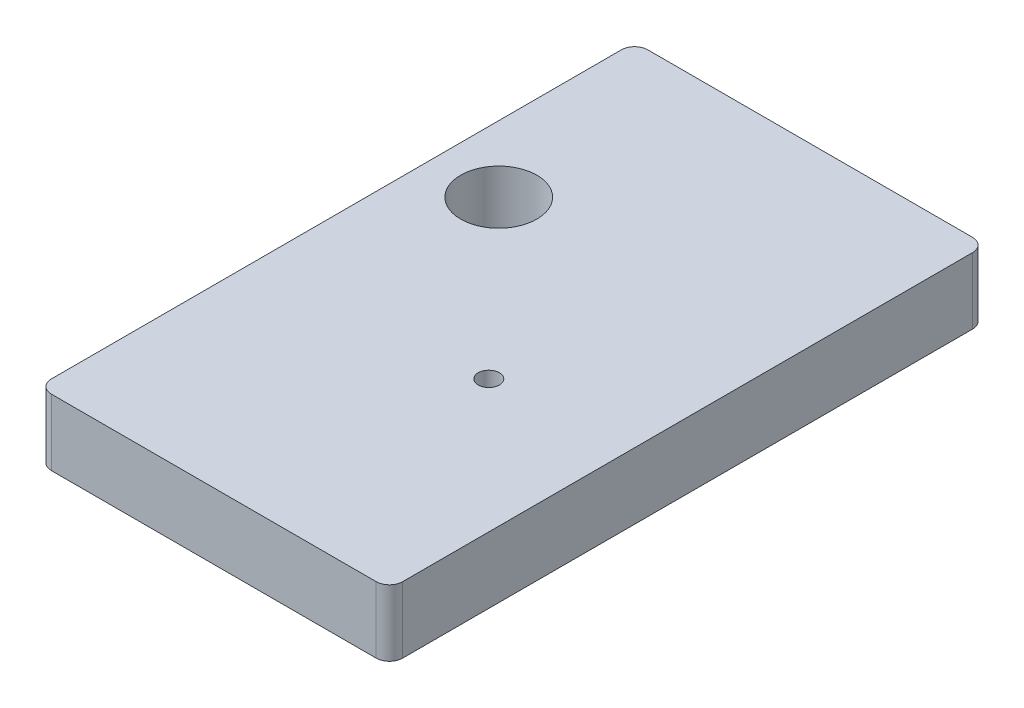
from build123d import *

# Parameters (mm, degrees)
ESQUISSE1_R             = 5.75
ESQUISSE1_R_2           = 1.6
EXTRUSION1_DEPTH        = 10
ESQUISSE2_R             = 1.1
ENL_V_MAT_EXTRU_1_DEPTH = 4


with BuildPart() as part:
    # Esquisse1 → Extrusion1 (new body)
    with BuildSketch(Plane(origin=(0, 0, 0), x_dir=(1, 0, 0), z_dir=(0, 1, 0))):
        with BuildLine():
            Line((0, 88), (0, 2))
            ThreePointArc((0, 2), (0.585786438, 0.585786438), (2, 0))
            Line((2, 0), (51, 0))
            ThreePointArc((51, 0), (52.414213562, 0.585786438), (53, 2))
            Line((53, 2), (53, 88))
            ThreePointArc((53, 88), (52.414213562, 89.414213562), (51, 90))
            Line((51, 90), (2, 90))
            ThreePointArc((2, 90), (0.585786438, 89.414213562), (0, 88))
        make_face()
        with Locations(Location((10, 59.5, 0), (0, 0, 270))):
            Circle(ESQUISSE1_R, mode=Mode.SUBTRACT)
        with Locations(Location((33, 35, 0), (0, 0, 270))):
            Circle(ESQUISSE1_R_2, mode=Mode.SUBTRACT)
    extrude(amount=EXTRUSION1_DEPTH)

    # Esquisse2 → Enl_v. mat.-Extru.1 (cut)
    with BuildSketch(Plane.XZ):
        with Locations(Location((45, -23, 0), (0, 0, 270))):
            Circle(ESQUISSE2_R)
        with Locations(Location((45, -7, 0), (0, 0, 270))):
            Circle(ESQUISSE2_R)
        with BuildLine():
            Line((41, -82.7372583), (41, -81.2627417))
            ThreePointArc((41, -81.2627417), (41, -79), (38.7372583, -79))
            Line((38.7372583, -79), (27.2627417, -79))
            ThreePointArc((27.2627417, -79), (25, -79), (25, -81.2627417))
            Line((25, -81.2627417), (25, -82.7372583))
            ThreePointArc((25, -82.7372583), (25, -85), (27.2627417, -85))
            Line((27.2627417, -85), (38.7372583, -85))
            ThreePointArc((38.7372583, -85), (41, -85), (41, -82.7372583))
        make_face()
        with BuildLine():
            Line((45.7372583, -49.5), (44.2627417, -49.5))
            ThreePointArc((44.2627417, -49.5), (42, -49.5), (42, -51.7627417))
            Line((42, -51.7627417), (42, -67.2372583))
            ThreePointArc((42, -67.2372583), (42, -69.5), (44.2627417, -69.5))
            Line((44.2627417, -69.5), (45.7372583, -69.5))
            ThreePointArc((45.7372583, -69.5), (48, -69.5), (48, -67.2372583))
            Line((48, -67.2372583), (48, -51.7627417))
            ThreePointArc((48, -51.7627417), (48, -49.5), (45.7372583, -49.5))
        make_face()
        with BuildLine():
            Line((24, -67.2372583), (24, -51.7627417))
            ThreePointArc((24, -51.7627417), (24, -49.5), (21.7372583, -49.5))
            Line((21.7372583, -49.5), (20.2627417, -49.5))
            ThreePointArc((20.2627417, -49.5), (18, -49.5), (18, -51.7627417))
            Line((18, -51.7627417), (18, -67.2372583))
            ThreePointArc((18, -67.2372583), (18, -69.5), (20.2627417, -69.5))
            Line((20.2627417, -69.5), (21.7372583, -69.5))
            ThreePointArc((21.7372583, -69.5), (24, -69.5), (24, -67.2372583))
        make_face()
    extrude(amount=-ENL_V_MAT_EXTRU_1_DEPTH, mode=Mode.SUBTRACT)


solid = part.part
